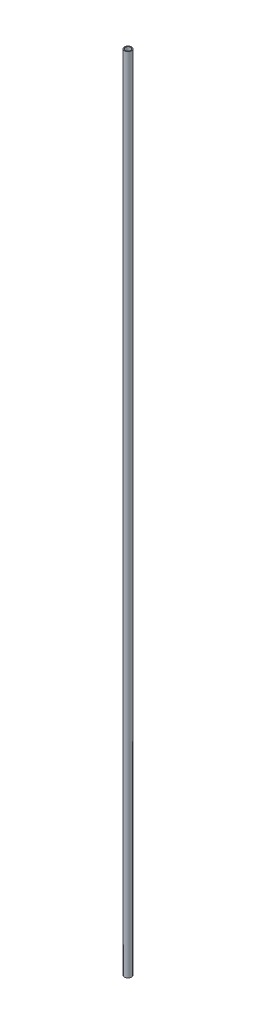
from build123d import *

# Parameters (mm, degrees)
SKETCH1_R           = 13.335
SKETCH1_R_2         = 10.2108
BOSS_EXTRUDE1_DEPTH = 3048


with BuildPart() as part:
    # Sketch1 → Boss-Extrude1 (new body)
    with BuildSketch(Plane(origin=(0, 0, 0), x_dir=(1, 0, 0), z_dir=(0, 1, 0))):
        with Locations(Location((0, 0, 0), (0, 0, 270))):
            Circle(SKETCH1_R)
        with Locations(Location((0, 0, 0), (0, 0, 270))):
            Circle(SKETCH1_R_2, mode=Mode.SUBTRACT)
    extrude(amount=BOSS_EXTRUDE1_DEPTH)


solid = part.part
